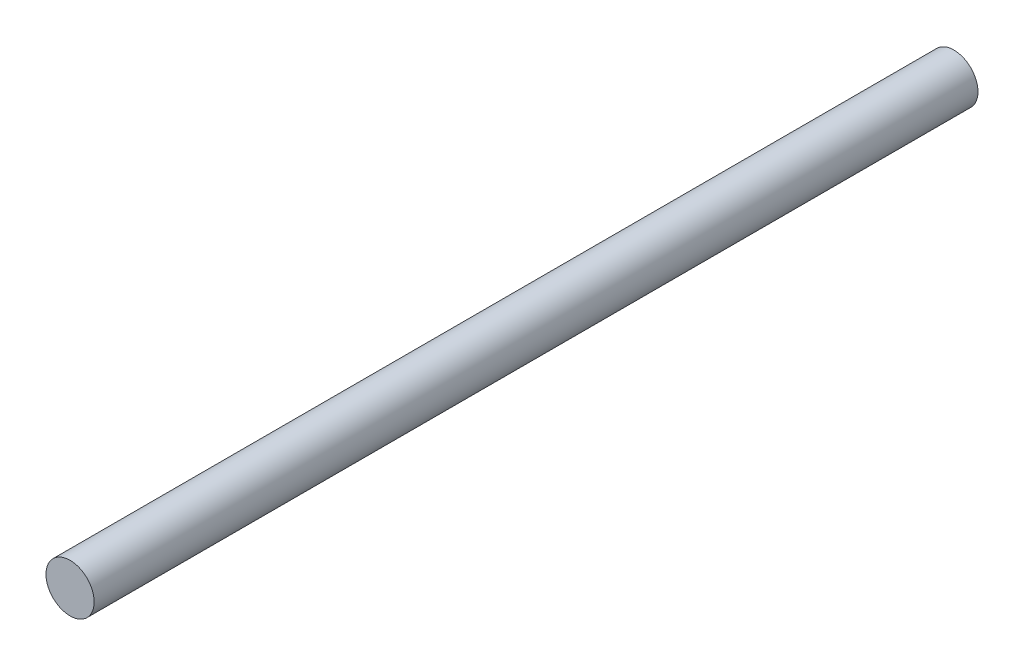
ISO-10303-21;
HEADER;
FILE_DESCRIPTION(('STEP AP214'),'2;1');
FILE_NAME('part.step','',(''),(''),'','','');
FILE_SCHEMA(('AUTOMOTIVE_DESIGN { 1 0 10303 214 1 1 1 1 }'));
ENDSEC;
DATA;
#1=APPLICATION_CONTEXT('core data for automotive mechanical design processes');
#2=APPLICATION_PROTOCOL_DEFINITION('international standard','automotive_design',2000,#1);
#3=PRODUCT_CONTEXT('',#1,'mechanical');
#4=PRODUCT('Part','Part','',(#3));
#5=PRODUCT_RELATED_PRODUCT_CATEGORY('part','',(#4));
#6=PRODUCT_DEFINITION_FORMATION('','',#4);
#7=PRODUCT_DEFINITION_CONTEXT('part definition',#1,'design');
#8=PRODUCT_DEFINITION('design','',#6,#7);
#9=PRODUCT_DEFINITION_SHAPE('','',#8);
#10=(LENGTH_UNIT() NAMED_UNIT(*) SI_UNIT(.MILLI.,.METRE.));
#11=(NAMED_UNIT(*) PLANE_ANGLE_UNIT() SI_UNIT($,.RADIAN.));
#12=(NAMED_UNIT(*) SI_UNIT($,.STERADIAN.) SOLID_ANGLE_UNIT());
#13=UNCERTAINTY_MEASURE_WITH_UNIT(LENGTH_MEASURE(1.E-05),#10,'distance_accuracy_value','');
#14=(GEOMETRIC_REPRESENTATION_CONTEXT(3) GLOBAL_UNCERTAINTY_ASSIGNED_CONTEXT((#13)) GLOBAL_UNIT_ASSIGNED_CONTEXT((#10,
#11,#12)) REPRESENTATION_CONTEXT('',''));
#15=CARTESIAN_POINT('',(0.,0.,0.));
#16=DIRECTION('',(0.,0.,1.));
#17=DIRECTION('',(1.,0.,0.));
#18=AXIS2_PLACEMENT_3D('',#15,#16,#17);
#19=CARTESIAN_POINT('',(0.,0.,-1100.));
#20=DIRECTION('',(0.,0.,1.));
#21=DIRECTION('',(1.,0.,0.));
#22=AXIS2_PLACEMENT_3D('',#19,#20,#21);
#23=CYLINDRICAL_SURFACE('',#22,30.);
#24=CARTESIAN_POINT('',(0.,0.,-1100.));
#25=DIRECTION('',(0.,0.,1.));
#26=DIRECTION('',(1.,0.,0.));
#27=AXIS2_PLACEMENT_3D('',#24,#25,#26);
#28=CIRCLE('',#27,30.);
#29=CARTESIAN_POINT('',(30.,0.,-1100.));
#30=VERTEX_POINT('',#29);
#31=EDGE_CURVE('E10',#30,#30,#28,.T.);
#32=ORIENTED_EDGE('',*,*,#31,.T.);
#33=EDGE_LOOP('',(#32));
#34=FACE_BOUND('',#33,.T.);
#35=CARTESIAN_POINT('',(0.,0.,0.));
#36=DIRECTION('',(0.,0.,1.));
#37=DIRECTION('',(1.,0.,0.));
#38=AXIS2_PLACEMENT_3D('',#35,#36,#37);
#39=CIRCLE('',#38,30.);
#40=CARTESIAN_POINT('',(30.,0.,0.));
#41=VERTEX_POINT('',#40);
#42=EDGE_CURVE('E40',#41,#41,#39,.T.);
#43=ORIENTED_EDGE('',*,*,#42,.F.);
#44=EDGE_LOOP('',(#43));
#45=FACE_BOUND('',#44,.T.);
#46=ADVANCED_FACE('F37',(#34,#45),#23,.T.);
#47=CARTESIAN_POINT('',(0.,0.,-1100.));
#48=DIRECTION('',(0.,0.,1.));
#49=DIRECTION('',(1.,0.,0.));
#50=AXIS2_PLACEMENT_3D('',#47,#48,#49);
#51=PLANE('',#50);
#52=ORIENTED_EDGE('',*,*,#31,.F.);
#53=EDGE_LOOP('',(#52));
#54=FACE_BOUND('',#53,.T.);
#55=ADVANCED_FACE('F54',(#54),#51,.F.);
#56=CARTESIAN_POINT('',(0.,0.,0.));
#57=DIRECTION('',(0.,0.,1.));
#58=DIRECTION('',(1.,0.,0.));
#59=AXIS2_PLACEMENT_3D('',#56,#57,#58);
#60=PLANE('',#59);
#61=ORIENTED_EDGE('',*,*,#42,.T.);
#62=EDGE_LOOP('',(#61));
#63=FACE_BOUND('',#62,.T.);
#64=ADVANCED_FACE('F51',(#63),#60,.T.);
#65=CLOSED_SHELL('',(#46,#55,#64));
#66=MANIFOLD_SOLID_BREP('B2',#65);
#67=ADVANCED_BREP_SHAPE_REPRESENTATION('',(#18,#66),#14);
#68=SHAPE_DEFINITION_REPRESENTATION(#9,#67);
ENDSEC;
END-ISO-10303-21;
